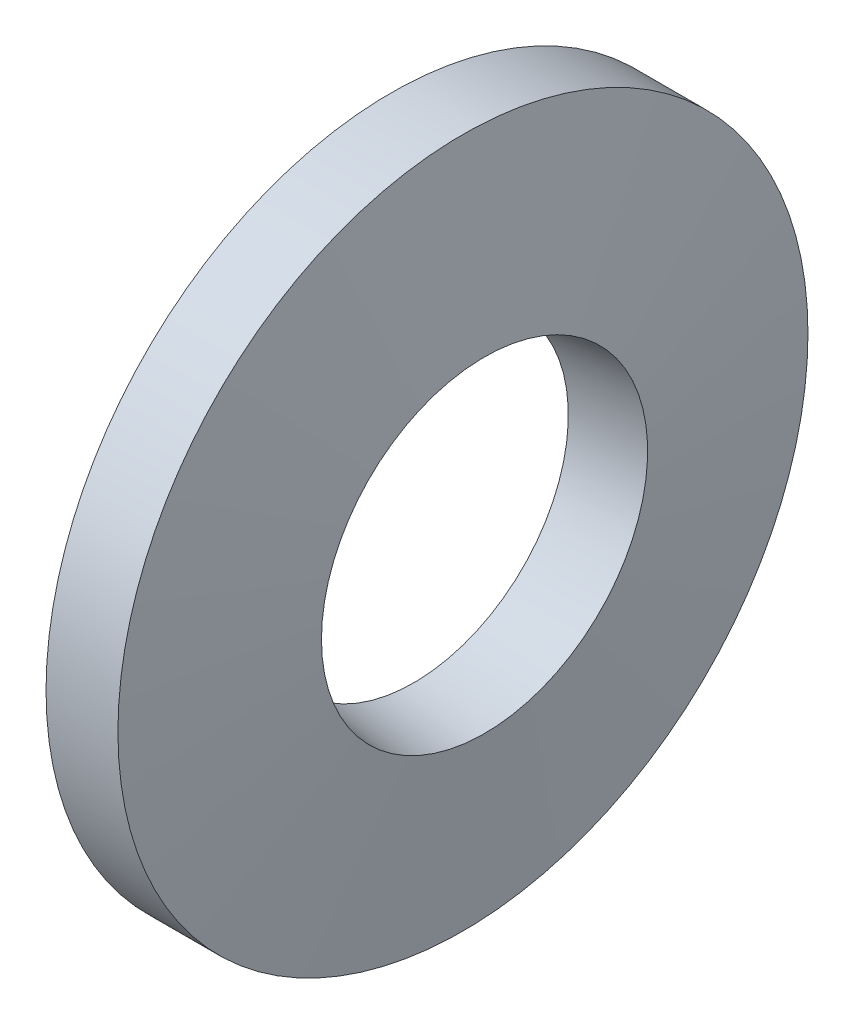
ISO-10303-21;
HEADER;
FILE_DESCRIPTION(('STEP AP214'),'2;1');
FILE_NAME('part.step','',(''),(''),'','','');
FILE_SCHEMA(('AUTOMOTIVE_DESIGN { 1 0 10303 214 1 1 1 1 }'));
ENDSEC;
DATA;
#1=APPLICATION_CONTEXT('core data for automotive mechanical design processes');
#2=APPLICATION_PROTOCOL_DEFINITION('international standard','automotive_design',2000,#1);
#3=PRODUCT_CONTEXT('',#1,'mechanical');
#4=PRODUCT('Part','Part','',(#3));
#5=PRODUCT_RELATED_PRODUCT_CATEGORY('part','',(#4));
#6=PRODUCT_DEFINITION_FORMATION('','',#4);
#7=PRODUCT_DEFINITION_CONTEXT('part definition',#1,'design');
#8=PRODUCT_DEFINITION('design','',#6,#7);
#9=PRODUCT_DEFINITION_SHAPE('','',#8);
#10=(LENGTH_UNIT() NAMED_UNIT(*) SI_UNIT(.MILLI.,.METRE.));
#11=(NAMED_UNIT(*) PLANE_ANGLE_UNIT() SI_UNIT($,.RADIAN.));
#12=(NAMED_UNIT(*) SI_UNIT($,.STERADIAN.) SOLID_ANGLE_UNIT());
#13=UNCERTAINTY_MEASURE_WITH_UNIT(LENGTH_MEASURE(1.E-05),#10,'distance_accuracy_value','');
#14=(GEOMETRIC_REPRESENTATION_CONTEXT(3) GLOBAL_UNCERTAINTY_ASSIGNED_CONTEXT((#13)) GLOBAL_UNIT_ASSIGNED_CONTEXT((#10,
#11,#12)) REPRESENTATION_CONTEXT('',''));
#15=CARTESIAN_POINT('',(0.,0.,0.));
#16=DIRECTION('',(0.,0.,1.));
#17=DIRECTION('',(1.,0.,0.));
#18=AXIS2_PLACEMENT_3D('',#15,#16,#17);
#19=CARTESIAN_POINT('',(50.,0.,0.));
#20=DIRECTION('',(-1.,0.,0.));
#21=DIRECTION('',(0.,0.,1.));
#22=AXIS2_PLACEMENT_3D('',#19,#20,#21);
#23=CYLINDRICAL_SURFACE('',#22,14.5);
#24=CARTESIAN_POINT('',(0.,0.,0.));
#25=DIRECTION('',(-1.,0.,0.));
#26=DIRECTION('',(0.,0.,1.));
#27=AXIS2_PLACEMENT_3D('',#24,#25,#26);
#28=CIRCLE('',#27,14.5);
#29=CARTESIAN_POINT('',(0.,0.,14.5));
#30=VERTEX_POINT('',#29);
#31=EDGE_CURVE('E10',#30,#30,#28,.T.);
#32=ORIENTED_EDGE('',*,*,#31,.F.);
#33=EDGE_LOOP('',(#32));
#34=FACE_BOUND('',#33,.T.);
#35=CARTESIAN_POINT('',(3.0210782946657,0.,0.));
#36=DIRECTION('',(-1.,0.,0.));
#37=DIRECTION('',(0.,0.,1.));
#38=AXIS2_PLACEMENT_3D('',#35,#36,#37);
#39=CIRCLE('',#38,14.5);
#40=CARTESIAN_POINT('',(3.0210782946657,0.,14.5));
#41=VERTEX_POINT('',#40);
#42=EDGE_CURVE('E45',#41,#41,#39,.T.);
#43=ORIENTED_EDGE('',*,*,#42,.T.);
#44=EDGE_LOOP('',(#43));
#45=FACE_BOUND('',#44,.T.);
#46=ADVANCED_FACE('F31',(#34,#45),#23,.T.);
#47=CARTESIAN_POINT('',(0.,0.,0.));
#48=DIRECTION('',(-1.,0.,0.));
#49=DIRECTION('',(0.,0.,1.));
#50=AXIS2_PLACEMENT_3D('',#47,#48,#49);
#51=CONICAL_SURFACE('',#50,14.5,1.45259983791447);
#52=CARTESIAN_POINT('',(0.95,0.,0.));
#53=DIRECTION('',(-1.,0.,0.));
#54=DIRECTION('',(0.,0.,1.));
#55=AXIS2_PLACEMENT_3D('',#52,#53,#54);
#56=CIRCLE('',#55,6.5);
#57=CARTESIAN_POINT('',(0.95,0.,6.5));
#58=VERTEX_POINT('',#57);
#59=EDGE_CURVE('E37',#58,#58,#56,.T.);
#60=ORIENTED_EDGE('',*,*,#59,.F.);
#61=EDGE_LOOP('',(#60));
#62=FACE_BOUND('',#61,.T.);
#63=ORIENTED_EDGE('',*,*,#31,.T.);
#64=EDGE_LOOP('',(#63));
#65=FACE_BOUND('',#64,.T.);
#66=ADVANCED_FACE('F60',(#62,#65),#51,.F.);
#67=CARTESIAN_POINT('',(0.95,0.,0.));
#68=DIRECTION('',(1.,0.,0.));
#69=DIRECTION('',(0.,0.,-1.));
#70=AXIS2_PLACEMENT_3D('',#67,#68,#69);
#71=CONICAL_SURFACE('',#70,6.5,0.118196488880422);
#72=CARTESIAN_POINT('',(3.9290687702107,0.,0.));
#73=DIRECTION('',(-1.,0.,0.));
#74=DIRECTION('',(0.,0.,1.));
#75=AXIS2_PLACEMENT_3D('',#72,#73,#74);
#76=CIRCLE('',#75,6.8537644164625);
#77=CARTESIAN_POINT('',(3.9290687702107,0.,6.8537644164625));
#78=VERTEX_POINT('',#77);
#79=EDGE_CURVE('E41',#78,#78,#76,.T.);
#80=ORIENTED_EDGE('',*,*,#79,.F.);
#81=EDGE_LOOP('',(#80));
#82=FACE_BOUND('',#81,.T.);
#83=ORIENTED_EDGE('',*,*,#59,.T.);
#84=EDGE_LOOP('',(#83));
#85=FACE_BOUND('',#84,.T.);
#86=ADVANCED_FACE('F55',(#82,#85),#71,.F.);
#87=CARTESIAN_POINT('',(3.9290687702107,0.,0.));
#88=DIRECTION('',(-1.,0.,0.));
#89=DIRECTION('',(0.,0.,1.));
#90=AXIS2_PLACEMENT_3D('',#87,#88,#89);
#91=CONICAL_SURFACE('',#90,6.8537644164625,1.45259983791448);
#92=ORIENTED_EDGE('',*,*,#42,.F.);
#93=EDGE_LOOP('',(#92));
#94=FACE_BOUND('',#93,.T.);
#95=ORIENTED_EDGE('',*,*,#79,.T.);
#96=EDGE_LOOP('',(#95));
#97=FACE_BOUND('',#96,.T.);
#98=ADVANCED_FACE('F52',(#94,#97),#91,.T.);
#99=CLOSED_SHELL('',(#46,#66,#86,#98));
#100=MANIFOLD_SOLID_BREP('B2',#99);
#101=ADVANCED_BREP_SHAPE_REPRESENTATION('',(#18,#100),#14);
#102=SHAPE_DEFINITION_REPRESENTATION(#9,#101);
ENDSEC;
END-ISO-10303-21;
